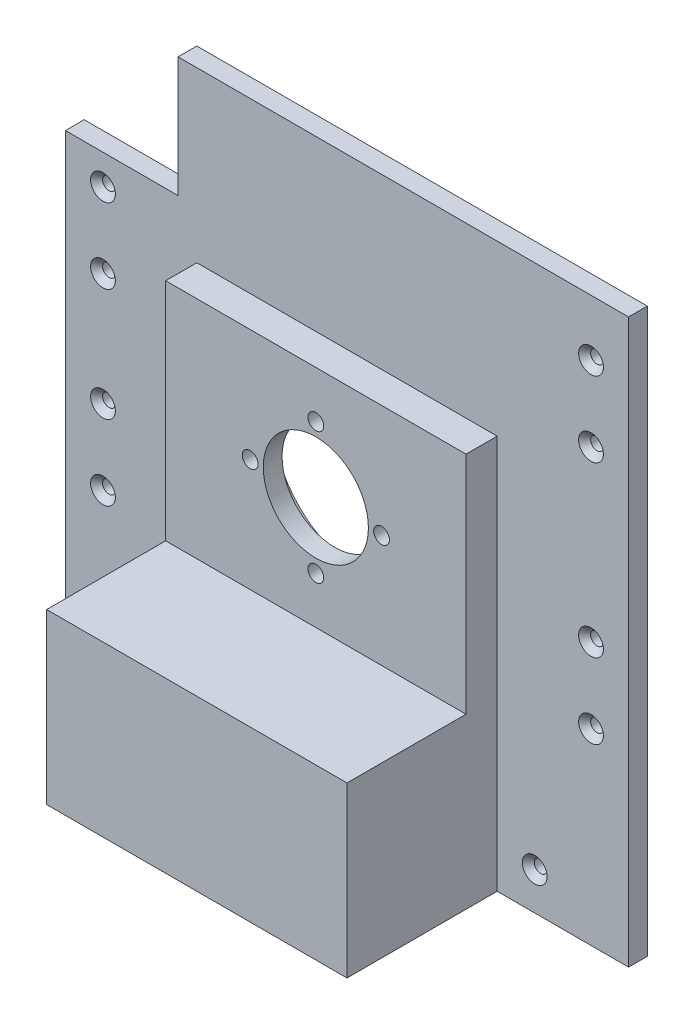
ISO-10303-21;
HEADER;
FILE_DESCRIPTION(('STEP AP214'),'2;1');
FILE_NAME('part.step','',(''),(''),'','','');
FILE_SCHEMA(('AUTOMOTIVE_DESIGN { 1 0 10303 214 1 1 1 1 }'));
ENDSEC;
DATA;
#1=APPLICATION_CONTEXT('core data for automotive mechanical design processes');
#2=APPLICATION_PROTOCOL_DEFINITION('international standard','automotive_design',2000,#1);
#3=PRODUCT_CONTEXT('',#1,'mechanical');
#4=PRODUCT('Part','Part','',(#3));
#5=PRODUCT_RELATED_PRODUCT_CATEGORY('part','',(#4));
#6=PRODUCT_DEFINITION_FORMATION('','',#4);
#7=PRODUCT_DEFINITION_CONTEXT('part definition',#1,'design');
#8=PRODUCT_DEFINITION('design','',#6,#7);
#9=PRODUCT_DEFINITION_SHAPE('','',#8);
#10=(LENGTH_UNIT() NAMED_UNIT(*) SI_UNIT(.MILLI.,.METRE.));
#11=(NAMED_UNIT(*) PLANE_ANGLE_UNIT() SI_UNIT($,.RADIAN.));
#12=(NAMED_UNIT(*) SI_UNIT($,.STERADIAN.) SOLID_ANGLE_UNIT());
#13=UNCERTAINTY_MEASURE_WITH_UNIT(LENGTH_MEASURE(1.E-05),#10,'distance_accuracy_value','');
#14=(GEOMETRIC_REPRESENTATION_CONTEXT(3) GLOBAL_UNCERTAINTY_ASSIGNED_CONTEXT((#13)) GLOBAL_UNIT_ASSIGNED_CONTEXT((#10,
#11,#12)) REPRESENTATION_CONTEXT('',''));
#15=CARTESIAN_POINT('',(0.,0.,0.));
#16=DIRECTION('',(0.,0.,1.));
#17=DIRECTION('',(1.,0.,0.));
#18=AXIS2_PLACEMENT_3D('',#15,#16,#17);
#19=CARTESIAN_POINT('',(0.,0.,5.));
#20=DIRECTION('',(0.,0.,1.));
#21=DIRECTION('',(1.,0.,0.));
#22=AXIS2_PLACEMENT_3D('',#19,#20,#21);
#23=PLANE('',#22);
#24=DIRECTION('',(0.,1.,0.));
#25=VECTOR('',#24,1.);
#26=CARTESIAN_POINT('',(-45.,75.,5.));
#27=LINE('',#26,#25);
#28=CARTESIAN_POINT('',(-45.,43.,5.));
#29=VERTEX_POINT('',#28);
#30=CARTESIAN_POINT('',(-45.,75.,5.));
#31=VERTEX_POINT('',#30);
#32=EDGE_CURVE('E137',#29,#31,#27,.T.);
#33=ORIENTED_EDGE('',*,*,#32,.F.);
#34=DIRECTION('',(1.,0.,0.));
#35=VECTOR('',#34,1.);
#36=CARTESIAN_POINT('',(-45.,43.,5.));
#37=LINE('',#36,#35);
#38=CARTESIAN_POINT('',(-75.,43.,5.));
#39=VERTEX_POINT('',#38);
#40=EDGE_CURVE('E152',#39,#29,#37,.T.);
#41=ORIENTED_EDGE('',*,*,#40,.F.);
#42=DIRECTION('',(0.,-1.,0.));
#43=VECTOR('',#42,1.);
#44=CARTESIAN_POINT('',(-75.,75.,5.));
#45=LINE('',#44,#43);
#46=CARTESIAN_POINT('',(-75.,-75.,5.));
#47=VERTEX_POINT('',#46);
#48=EDGE_CURVE('E404',#39,#47,#45,.T.);
#49=ORIENTED_EDGE('',*,*,#48,.T.);
#50=DIRECTION('',(1.,0.,0.));
#51=VECTOR('',#50,1.);
#52=CARTESIAN_POINT('',(-75.,-75.,5.));
#53=LINE('',#52,#51);
#54=CARTESIAN_POINT('',(-40.,-75.,5.));
#55=VERTEX_POINT('',#54);
#56=EDGE_CURVE('E178',#47,#55,#53,.T.);
#57=ORIENTED_EDGE('',*,*,#56,.T.);
#58=DIRECTION('',(0.,-1.,0.));
#59=VECTOR('',#58,1.);
#60=CARTESIAN_POINT('',(-40.,30.,5.));
#61=LINE('',#60,#59);
#62=CARTESIAN_POINT('',(-40.,30.,5.));
#63=VERTEX_POINT('',#62);
#64=EDGE_CURVE('E374',#63,#55,#61,.T.);
#65=ORIENTED_EDGE('',*,*,#64,.F.);
#66=DIRECTION('',(-1.,0.,0.));
#67=VECTOR('',#66,1.);
#68=CARTESIAN_POINT('',(-40.,30.,5.));
#69=LINE('',#68,#67);
#70=CARTESIAN_POINT('',(40.,30.,5.));
#71=VERTEX_POINT('',#70);
#72=EDGE_CURVE('E70',#71,#63,#69,.T.);
#73=ORIENTED_EDGE('',*,*,#72,.F.);
#74=DIRECTION('',(0.,1.,0.));
#75=VECTOR('',#74,1.);
#76=CARTESIAN_POINT('',(40.,30.,5.));
#77=LINE('',#76,#75);
#78=CARTESIAN_POINT('',(40.,-75.,5.));
#79=VERTEX_POINT('',#78);
#80=EDGE_CURVE('E368',#79,#71,#77,.T.);
#81=ORIENTED_EDGE('',*,*,#80,.F.);
#82=CARTESIAN_POINT('',(75.,-75.,5.));
#83=VERTEX_POINT('',#82);
#84=EDGE_CURVE('E406',#79,#83,#53,.T.);
#85=ORIENTED_EDGE('',*,*,#84,.T.);
#86=DIRECTION('',(0.,1.,0.));
#87=VECTOR('',#86,1.);
#88=CARTESIAN_POINT('',(75.,75.,5.));
#89=LINE('',#88,#87);
#90=CARTESIAN_POINT('',(75.,75.,5.));
#91=VERTEX_POINT('',#90);
#92=EDGE_CURVE('E173',#83,#91,#89,.T.);
#93=ORIENTED_EDGE('',*,*,#92,.T.);
#94=DIRECTION('',(-1.,0.,0.));
#95=VECTOR('',#94,1.);
#96=CARTESIAN_POINT('',(-75.,75.,5.));
#97=LINE('',#96,#95);
#98=EDGE_CURVE('E401',#91,#31,#97,.T.);
#99=ORIENTED_EDGE('',*,*,#98,.T.);
#100=EDGE_LOOP('',(#33,#41,#49,#57,#65,#73,#81,#85,#93,#99));
#101=FACE_BOUND('',#100,.T.);
#102=CARTESIAN_POINT('',(-65.,-65.,5.));
#103=DIRECTION('',(0.,0.,1.));
#104=DIRECTION('',(1.,0.,0.));
#105=AXIS2_PLACEMENT_3D('',#102,#103,#104);
#106=CIRCLE('',#105,3.3);
#107=CARTESIAN_POINT('',(-61.7,-65.,5.));
#108=VERTEX_POINT('',#107);
#109=EDGE_CURVE('E991',#108,#108,#106,.T.);
#110=ORIENTED_EDGE('',*,*,#109,.F.);
#111=EDGE_LOOP('',(#110));
#112=FACE_BOUND('',#111,.T.);
#113=CARTESIAN_POINT('',(50.,-65.,5.));
#114=DIRECTION('',(0.,0.,1.));
#115=DIRECTION('',(1.,0.,0.));
#116=AXIS2_PLACEMENT_3D('',#113,#114,#115);
#117=CIRCLE('',#116,3.3);
#118=CARTESIAN_POINT('',(53.3,-65.,5.));
#119=VERTEX_POINT('',#118);
#120=EDGE_CURVE('E241',#119,#119,#117,.T.);
#121=ORIENTED_EDGE('',*,*,#120,.F.);
#122=EDGE_LOOP('',(#121));
#123=FACE_BOUND('',#122,.T.);
#124=CARTESIAN_POINT('',(65.,60.,5.));
#125=DIRECTION('',(0.,0.,1.));
#126=DIRECTION('',(1.,0.,0.));
#127=AXIS2_PLACEMENT_3D('',#124,#125,#126);
#128=CIRCLE('',#127,3.3);
#129=CARTESIAN_POINT('',(68.3,60.,5.));
#130=VERTEX_POINT('',#129);
#131=EDGE_CURVE('E231',#130,#130,#128,.T.);
#132=ORIENTED_EDGE('',*,*,#131,.F.);
#133=EDGE_LOOP('',(#132));
#134=FACE_BOUND('',#133,.T.);
#135=CARTESIAN_POINT('',(65.,40.,5.));
#136=DIRECTION('',(0.,0.,1.));
#137=DIRECTION('',(1.,0.,0.));
#138=AXIS2_PLACEMENT_3D('',#135,#136,#137);
#139=CIRCLE('',#138,3.3);
#140=CARTESIAN_POINT('',(68.3,40.,5.));
#141=VERTEX_POINT('',#140);
#142=EDGE_CURVE('E226',#141,#141,#139,.T.);
#143=ORIENTED_EDGE('',*,*,#142,.F.);
#144=EDGE_LOOP('',(#143));
#145=FACE_BOUND('',#144,.T.);
#146=CARTESIAN_POINT('',(65.,-4.99999999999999,5.));
#147=DIRECTION('',(0.,0.,1.));
#148=DIRECTION('',(1.,0.,0.));
#149=AXIS2_PLACEMENT_3D('',#146,#147,#148);
#150=CIRCLE('',#149,3.3);
#151=CARTESIAN_POINT('',(68.3,-4.99999999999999,5.));
#152=VERTEX_POINT('',#151);
#153=EDGE_CURVE('E221',#152,#152,#150,.T.);
#154=ORIENTED_EDGE('',*,*,#153,.F.);
#155=EDGE_LOOP('',(#154));
#156=FACE_BOUND('',#155,.T.);
#157=CARTESIAN_POINT('',(65.,-25.,5.));
#158=DIRECTION('',(0.,0.,1.));
#159=DIRECTION('',(1.,0.,0.));
#160=AXIS2_PLACEMENT_3D('',#157,#158,#159);
#161=CIRCLE('',#160,3.3);
#162=CARTESIAN_POINT('',(68.3,-25.,5.));
#163=VERTEX_POINT('',#162);
#164=EDGE_CURVE('E215',#163,#163,#161,.T.);
#165=ORIENTED_EDGE('',*,*,#164,.F.);
#166=EDGE_LOOP('',(#165));
#167=FACE_BOUND('',#166,.T.);
#168=CARTESIAN_POINT('',(-65.,35.,5.));
#169=DIRECTION('',(0.,0.,1.));
#170=DIRECTION('',(1.,0.,0.));
#171=AXIS2_PLACEMENT_3D('',#168,#169,#170);
#172=CIRCLE('',#171,3.3);
#173=CARTESIAN_POINT('',(-61.7,35.,5.));
#174=VERTEX_POINT('',#173);
#175=EDGE_CURVE('E209',#174,#174,#172,.T.);
#176=ORIENTED_EDGE('',*,*,#175,.F.);
#177=EDGE_LOOP('',(#176));
#178=FACE_BOUND('',#177,.T.);
#179=CARTESIAN_POINT('',(-65.,15.,5.));
#180=DIRECTION('',(0.,0.,1.));
#181=DIRECTION('',(1.,0.,0.));
#182=AXIS2_PLACEMENT_3D('',#179,#180,#181);
#183=CIRCLE('',#182,3.3);
#184=CARTESIAN_POINT('',(-61.7,15.,5.));
#185=VERTEX_POINT('',#184);
#186=EDGE_CURVE('E203',#185,#185,#183,.T.);
#187=ORIENTED_EDGE('',*,*,#186,.F.);
#188=EDGE_LOOP('',(#187));
#189=FACE_BOUND('',#188,.T.);
#190=CARTESIAN_POINT('',(-65.,-15.,5.));
#191=DIRECTION('',(0.,0.,1.));
#192=DIRECTION('',(1.,0.,0.));
#193=AXIS2_PLACEMENT_3D('',#190,#191,#192);
#194=CIRCLE('',#193,3.3);
#195=CARTESIAN_POINT('',(-61.7,-15.,5.));
#196=VERTEX_POINT('',#195);
#197=EDGE_CURVE('E198',#196,#196,#194,.T.);
#198=ORIENTED_EDGE('',*,*,#197,.F.);
#199=EDGE_LOOP('',(#198));
#200=FACE_BOUND('',#199,.T.);
#201=CARTESIAN_POINT('',(-65.,-35.,5.));
#202=DIRECTION('',(0.,0.,1.));
#203=DIRECTION('',(1.,0.,0.));
#204=AXIS2_PLACEMENT_3D('',#201,#202,#203);
#205=CIRCLE('',#204,3.3);
#206=CARTESIAN_POINT('',(-61.7,-35.,5.));
#207=VERTEX_POINT('',#206);
#208=EDGE_CURVE('E192',#207,#207,#205,.T.);
#209=ORIENTED_EDGE('',*,*,#208,.F.);
#210=EDGE_LOOP('',(#209));
#211=FACE_BOUND('',#210,.T.);
#212=ADVANCED_FACE('F44',(#101,#112,#123,#134,#145,#156,#167,#178,#189,#200,#211),#23,.T.);
#213=CARTESIAN_POINT('',(75.,75.,5.));
#214=DIRECTION('',(-1.,0.,0.));
#215=DIRECTION('',(0.,0.,1.));
#216=AXIS2_PLACEMENT_3D('',#213,#214,#215);
#217=PLANE('',#216);
#218=DIRECTION('',(0.,1.,0.));
#219=VECTOR('',#218,1.);
#220=CARTESIAN_POINT('',(75.,75.,0.));
#221=LINE('',#220,#219);
#222=CARTESIAN_POINT('',(75.,-75.,0.));
#223=VERTEX_POINT('',#222);
#224=CARTESIAN_POINT('',(75.,75.,0.));
#225=VERTEX_POINT('',#224);
#226=EDGE_CURVE('E159',#223,#225,#221,.T.);
#227=ORIENTED_EDGE('',*,*,#226,.T.);
#228=DIRECTION('',(0.,0.,-1.));
#229=VECTOR('',#228,1.);
#230=CARTESIAN_POINT('',(75.,75.,5.));
#231=LINE('',#230,#229);
#232=EDGE_CURVE('E11',#91,#225,#231,.T.);
#233=ORIENTED_EDGE('',*,*,#232,.F.);
#234=ORIENTED_EDGE('',*,*,#92,.F.);
#235=DIRECTION('',(0.,0.,-1.));
#236=VECTOR('',#235,1.);
#237=CARTESIAN_POINT('',(75.,-75.,5.));
#238=LINE('',#237,#236);
#239=EDGE_CURVE('E174',#83,#223,#238,.T.);
#240=ORIENTED_EDGE('',*,*,#239,.T.);
#241=EDGE_LOOP('',(#227,#233,#234,#240));
#242=FACE_BOUND('',#241,.T.);
#243=ADVANCED_FACE('F46',(#242),#217,.F.);
#244=CARTESIAN_POINT('',(-75.,75.,5.));
#245=DIRECTION('',(0.,-1.,0.));
#246=DIRECTION('',(0.,0.,-1.));
#247=AXIS2_PLACEMENT_3D('',#244,#245,#246);
#248=PLANE('',#247);
#249=DIRECTION('',(-1.,0.,0.));
#250=VECTOR('',#249,1.);
#251=CARTESIAN_POINT('',(-75.,75.,0.));
#252=LINE('',#251,#250);
#253=CARTESIAN_POINT('',(-45.,75.,0.));
#254=VERTEX_POINT('',#253);
#255=EDGE_CURVE('E149',#225,#254,#252,.T.);
#256=ORIENTED_EDGE('',*,*,#255,.T.);
#257=DIRECTION('',(0.,0.,1.));
#258=VECTOR('',#257,1.);
#259=CARTESIAN_POINT('',(-45.,75.,0.));
#260=LINE('',#259,#258);
#261=EDGE_CURVE('E134',#254,#31,#260,.T.);
#262=ORIENTED_EDGE('',*,*,#261,.T.);
#263=ORIENTED_EDGE('',*,*,#98,.F.);
#264=ORIENTED_EDGE('',*,*,#232,.T.);
#265=EDGE_LOOP('',(#256,#262,#263,#264));
#266=FACE_BOUND('',#265,.T.);
#267=ADVANCED_FACE('F154',(#266),#248,.F.);
#268=CARTESIAN_POINT('',(-75.,75.,5.));
#269=DIRECTION('',(1.,0.,0.));
#270=DIRECTION('',(0.,1.,0.));
#271=AXIS2_PLACEMENT_3D('',#268,#269,#270);
#272=PLANE('',#271);
#273=ORIENTED_EDGE('',*,*,#48,.F.);
#274=DIRECTION('',(0.,0.,1.));
#275=VECTOR('',#274,1.);
#276=CARTESIAN_POINT('',(-75.,43.,0.));
#277=LINE('',#276,#275);
#278=CARTESIAN_POINT('',(-75.,43.,0.));
#279=VERTEX_POINT('',#278);
#280=EDGE_CURVE('E142',#279,#39,#277,.T.);
#281=ORIENTED_EDGE('',*,*,#280,.F.);
#282=DIRECTION('',(0.,-1.,0.));
#283=VECTOR('',#282,1.);
#284=CARTESIAN_POINT('',(-75.,75.,0.));
#285=LINE('',#284,#283);
#286=CARTESIAN_POINT('',(-75.,-75.,0.));
#287=VERTEX_POINT('',#286);
#288=EDGE_CURVE('E158',#279,#287,#285,.T.);
#289=ORIENTED_EDGE('',*,*,#288,.T.);
#290=DIRECTION('',(0.,0.,-1.));
#291=VECTOR('',#290,1.);
#292=CARTESIAN_POINT('',(-75.,-75.,5.));
#293=LINE('',#292,#291);
#294=EDGE_CURVE('E54',#47,#287,#293,.T.);
#295=ORIENTED_EDGE('',*,*,#294,.F.);
#296=EDGE_LOOP('',(#273,#281,#289,#295));
#297=FACE_BOUND('',#296,.T.);
#298=ADVANCED_FACE('F424',(#297),#272,.F.);
#299=CARTESIAN_POINT('',(-75.,-75.,5.));
#300=DIRECTION('',(0.,1.,0.));
#301=DIRECTION('',(0.,0.,1.));
#302=AXIS2_PLACEMENT_3D('',#299,#300,#301);
#303=PLANE('',#302);
#304=DIRECTION('',(1.,0.,0.));
#305=VECTOR('',#304,1.);
#306=CARTESIAN_POINT('',(-75.,-75.,0.));
#307=LINE('',#306,#305);
#308=EDGE_CURVE('E164',#287,#223,#307,.T.);
#309=ORIENTED_EDGE('',*,*,#308,.T.);
#310=ORIENTED_EDGE('',*,*,#239,.F.);
#311=ORIENTED_EDGE('',*,*,#84,.F.);
#312=DIRECTION('',(0.,0.,-1.));
#313=VECTOR('',#312,1.);
#314=CARTESIAN_POINT('',(40.,-75.,45.));
#315=LINE('',#314,#313);
#316=CARTESIAN_POINT('',(40.,-75.,45.));
#317=VERTEX_POINT('',#316);
#318=EDGE_CURVE('E360',#317,#79,#315,.T.);
#319=ORIENTED_EDGE('',*,*,#318,.F.);
#320=DIRECTION('',(1.,0.,0.));
#321=VECTOR('',#320,1.);
#322=CARTESIAN_POINT('',(-40.,-75.,45.));
#323=LINE('',#322,#321);
#324=CARTESIAN_POINT('',(-40.,-75.,45.));
#325=VERTEX_POINT('',#324);
#326=EDGE_CURVE('E345',#325,#317,#323,.T.);
#327=ORIENTED_EDGE('',*,*,#326,.F.);
#328=DIRECTION('',(0.,0.,-1.));
#329=VECTOR('',#328,1.);
#330=CARTESIAN_POINT('',(-40.,-75.,45.));
#331=LINE('',#330,#329);
#332=EDGE_CURVE('E364',#325,#55,#331,.T.);
#333=ORIENTED_EDGE('',*,*,#332,.T.);
#334=ORIENTED_EDGE('',*,*,#56,.F.);
#335=ORIENTED_EDGE('',*,*,#294,.T.);
#336=EDGE_LOOP('',(#309,#310,#311,#319,#327,#333,#334,#335));
#337=FACE_BOUND('',#336,.T.);
#338=ADVANCED_FACE('F417',(#337),#303,.F.);
#339=CARTESIAN_POINT('',(0.,0.,0.));
#340=DIRECTION('',(0.,0.,1.));
#341=DIRECTION('',(1.,0.,0.));
#342=AXIS2_PLACEMENT_3D('',#339,#340,#341);
#343=PLANE('',#342);
#344=CARTESIAN_POINT('',(-65.,-65.,0.));
#345=DIRECTION('',(0.,0.,1.));
#346=DIRECTION('',(1.,0.,0.));
#347=AXIS2_PLACEMENT_3D('',#344,#345,#346);
#348=CIRCLE('',#347,1.69999999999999);
#349=CARTESIAN_POINT('',(-63.3,-65.,0.));
#350=VERTEX_POINT('',#349);
#351=EDGE_CURVE('E48',#350,#350,#348,.T.);
#352=ORIENTED_EDGE('',*,*,#351,.T.);
#353=EDGE_LOOP('',(#352));
#354=FACE_BOUND('',#353,.T.);
#355=CARTESIAN_POINT('',(50.,-65.,0.));
#356=DIRECTION('',(0.,0.,1.));
#357=DIRECTION('',(1.,0.,0.));
#358=AXIS2_PLACEMENT_3D('',#355,#356,#357);
#359=CIRCLE('',#358,1.69999999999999);
#360=CARTESIAN_POINT('',(51.7,-65.,0.));
#361=VERTEX_POINT('',#360);
#362=EDGE_CURVE('E228',#361,#361,#359,.T.);
#363=ORIENTED_EDGE('',*,*,#362,.T.);
#364=EDGE_LOOP('',(#363));
#365=FACE_BOUND('',#364,.T.);
#366=CARTESIAN_POINT('',(65.,60.,0.));
#367=DIRECTION('',(0.,0.,1.));
#368=DIRECTION('',(1.,0.,0.));
#369=AXIS2_PLACEMENT_3D('',#366,#367,#368);
#370=CIRCLE('',#369,1.69999999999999);
#371=CARTESIAN_POINT('',(66.7,60.,0.));
#372=VERTEX_POINT('',#371);
#373=EDGE_CURVE('E223',#372,#372,#370,.T.);
#374=ORIENTED_EDGE('',*,*,#373,.T.);
#375=EDGE_LOOP('',(#374));
#376=FACE_BOUND('',#375,.T.);
#377=CARTESIAN_POINT('',(65.,40.,0.));
#378=DIRECTION('',(0.,0.,1.));
#379=DIRECTION('',(1.,0.,0.));
#380=AXIS2_PLACEMENT_3D('',#377,#378,#379);
#381=CIRCLE('',#380,1.69999999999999);
#382=CARTESIAN_POINT('',(66.7,40.,0.));
#383=VERTEX_POINT('',#382);
#384=EDGE_CURVE('E217',#383,#383,#381,.T.);
#385=ORIENTED_EDGE('',*,*,#384,.T.);
#386=EDGE_LOOP('',(#385));
#387=FACE_BOUND('',#386,.T.);
#388=CARTESIAN_POINT('',(65.,-4.99999999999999,0.));
#389=DIRECTION('',(0.,0.,1.));
#390=DIRECTION('',(1.,0.,0.));
#391=AXIS2_PLACEMENT_3D('',#388,#389,#390);
#392=CIRCLE('',#391,1.69999999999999);
#393=CARTESIAN_POINT('',(66.7,-4.99999999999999,0.));
#394=VERTEX_POINT('',#393);
#395=EDGE_CURVE('E211',#394,#394,#392,.T.);
#396=ORIENTED_EDGE('',*,*,#395,.T.);
#397=EDGE_LOOP('',(#396));
#398=FACE_BOUND('',#397,.T.);
#399=CARTESIAN_POINT('',(65.,-25.,0.));
#400=DIRECTION('',(0.,0.,1.));
#401=DIRECTION('',(1.,0.,0.));
#402=AXIS2_PLACEMENT_3D('',#399,#400,#401);
#403=CIRCLE('',#402,1.69999999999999);
#404=CARTESIAN_POINT('',(66.7,-25.,0.));
#405=VERTEX_POINT('',#404);
#406=EDGE_CURVE('E205',#405,#405,#403,.T.);
#407=ORIENTED_EDGE('',*,*,#406,.T.);
#408=EDGE_LOOP('',(#407));
#409=FACE_BOUND('',#408,.T.);
#410=CARTESIAN_POINT('',(-65.,35.,0.));
#411=DIRECTION('',(0.,0.,1.));
#412=DIRECTION('',(1.,0.,0.));
#413=AXIS2_PLACEMENT_3D('',#410,#411,#412);
#414=CIRCLE('',#413,1.69999999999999);
#415=CARTESIAN_POINT('',(-63.3,35.,0.));
#416=VERTEX_POINT('',#415);
#417=EDGE_CURVE('E200',#416,#416,#414,.T.);
#418=ORIENTED_EDGE('',*,*,#417,.T.);
#419=EDGE_LOOP('',(#418));
#420=FACE_BOUND('',#419,.T.);
#421=CARTESIAN_POINT('',(-65.,15.,0.));
#422=DIRECTION('',(0.,0.,1.));
#423=DIRECTION('',(1.,0.,0.));
#424=AXIS2_PLACEMENT_3D('',#421,#422,#423);
#425=CIRCLE('',#424,1.69999999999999);
#426=CARTESIAN_POINT('',(-63.3,15.,0.));
#427=VERTEX_POINT('',#426);
#428=EDGE_CURVE('E194',#427,#427,#425,.T.);
#429=ORIENTED_EDGE('',*,*,#428,.T.);
#430=EDGE_LOOP('',(#429));
#431=FACE_BOUND('',#430,.T.);
#432=CARTESIAN_POINT('',(-65.,-15.,0.));
#433=DIRECTION('',(0.,0.,1.));
#434=DIRECTION('',(1.,0.,0.));
#435=AXIS2_PLACEMENT_3D('',#432,#433,#434);
#436=CIRCLE('',#435,1.69999999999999);
#437=CARTESIAN_POINT('',(-63.3,-15.,0.));
#438=VERTEX_POINT('',#437);
#439=EDGE_CURVE('E188',#438,#438,#436,.T.);
#440=ORIENTED_EDGE('',*,*,#439,.T.);
#441=EDGE_LOOP('',(#440));
#442=FACE_BOUND('',#441,.T.);
#443=CARTESIAN_POINT('',(-65.,-35.,0.));
#444=DIRECTION('',(0.,0.,1.));
#445=DIRECTION('',(1.,0.,0.));
#446=AXIS2_PLACEMENT_3D('',#443,#444,#445);
#447=CIRCLE('',#446,1.69999999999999);
#448=CARTESIAN_POINT('',(-63.3,-35.,0.));
#449=VERTEX_POINT('',#448);
#450=EDGE_CURVE('E182',#449,#449,#447,.T.);
#451=ORIENTED_EDGE('',*,*,#450,.T.);
#452=EDGE_LOOP('',(#451));
#453=FACE_BOUND('',#452,.T.);
#454=CARTESIAN_POINT('',(0.,0.,0.));
#455=DIRECTION('',(0.,0.,-1.));
#456=DIRECTION('',(-1.,0.,0.));
#457=AXIS2_PLACEMENT_3D('',#454,#455,#456);
#458=CIRCLE('',#457,25.);
#459=CARTESIAN_POINT('',(-25.,0.,0.));
#460=VERTEX_POINT('',#459);
#461=EDGE_CURVE('E333',#460,#460,#458,.T.);
#462=ORIENTED_EDGE('',*,*,#461,.F.);
#463=EDGE_LOOP('',(#462));
#464=FACE_BOUND('',#463,.T.);
#465=DIRECTION('',(1.,0.,0.));
#466=VECTOR('',#465,1.);
#467=CARTESIAN_POINT('',(-45.,43.,0.));
#468=LINE('',#467,#466);
#469=CARTESIAN_POINT('',(-45.,43.,0.));
#470=VERTEX_POINT('',#469);
#471=EDGE_CURVE('E143',#279,#470,#468,.T.);
#472=ORIENTED_EDGE('',*,*,#471,.T.);
#473=DIRECTION('',(0.,1.,0.));
#474=VECTOR('',#473,1.);
#475=CARTESIAN_POINT('',(-45.,75.,0.));
#476=LINE('',#475,#474);
#477=EDGE_CURVE('E62',#470,#254,#476,.T.);
#478=ORIENTED_EDGE('',*,*,#477,.T.);
#479=ORIENTED_EDGE('',*,*,#255,.F.);
#480=ORIENTED_EDGE('',*,*,#226,.F.);
#481=ORIENTED_EDGE('',*,*,#308,.F.);
#482=ORIENTED_EDGE('',*,*,#288,.F.);
#483=EDGE_LOOP('',(#472,#478,#479,#480,#481,#482));
#484=FACE_BOUND('',#483,.T.);
#485=ADVANCED_FACE('F147',(#354,#365,#376,#387,#398,#409,#420,#431,#442,#453,#464,#484),#343,.F.);
#486=CARTESIAN_POINT('',(40.,30.,13.3));
#487=DIRECTION('',(-1.,0.,0.));
#488=DIRECTION('',(0.,0.,1.));
#489=AXIS2_PLACEMENT_3D('',#486,#487,#488);
#490=PLANE('',#489);
#491=ORIENTED_EDGE('',*,*,#80,.T.);
#492=DIRECTION('',(0.,0.,-1.));
#493=VECTOR('',#492,1.);
#494=CARTESIAN_POINT('',(40.,30.,13.3));
#495=LINE('',#494,#493);
#496=CARTESIAN_POINT('',(40.,30.,13.3));
#497=VERTEX_POINT('',#496);
#498=EDGE_CURVE('E167',#497,#71,#495,.T.);
#499=ORIENTED_EDGE('',*,*,#498,.F.);
#500=DIRECTION('',(0.,1.,0.));
#501=VECTOR('',#500,1.);
#502=CARTESIAN_POINT('',(40.,30.,13.3));
#503=LINE('',#502,#501);
#504=CARTESIAN_POINT('',(40.,-30.,13.3));
#505=VERTEX_POINT('',#504);
#506=EDGE_CURVE('E369',#505,#497,#503,.T.);
#507=ORIENTED_EDGE('',*,*,#506,.F.);
#508=DIRECTION('',(0.,0.,-1.));
#509=VECTOR('',#508,1.);
#510=CARTESIAN_POINT('',(40.,-30.,45.));
#511=LINE('',#510,#509);
#512=CARTESIAN_POINT('',(40.,-30.,45.));
#513=VERTEX_POINT('',#512);
#514=EDGE_CURVE('E357',#513,#505,#511,.T.);
#515=ORIENTED_EDGE('',*,*,#514,.F.);
#516=DIRECTION('',(0.,1.,0.));
#517=VECTOR('',#516,1.);
#518=CARTESIAN_POINT('',(40.,-30.,45.));
#519=LINE('',#518,#517);
#520=EDGE_CURVE('E348',#317,#513,#519,.T.);
#521=ORIENTED_EDGE('',*,*,#520,.F.);
#522=ORIENTED_EDGE('',*,*,#318,.T.);
#523=EDGE_LOOP('',(#491,#499,#507,#515,#521,#522));
#524=FACE_BOUND('',#523,.T.);
#525=ADVANCED_FACE('F436',(#524),#490,.F.);
#526=CARTESIAN_POINT('',(-40.,30.,13.3));
#527=DIRECTION('',(0.,-1.,0.));
#528=DIRECTION('',(0.,0.,-1.));
#529=AXIS2_PLACEMENT_3D('',#526,#527,#528);
#530=PLANE('',#529);
#531=ORIENTED_EDGE('',*,*,#72,.T.);
#532=DIRECTION('',(0.,0.,-1.));
#533=VECTOR('',#532,1.);
#534=CARTESIAN_POINT('',(-40.,30.,13.3));
#535=LINE('',#534,#533);
#536=CARTESIAN_POINT('',(-40.,30.,13.3));
#537=VERTEX_POINT('',#536);
#538=EDGE_CURVE('E385',#537,#63,#535,.T.);
#539=ORIENTED_EDGE('',*,*,#538,.F.);
#540=DIRECTION('',(-1.,0.,0.));
#541=VECTOR('',#540,1.);
#542=CARTESIAN_POINT('',(-40.,30.,13.3));
#543=LINE('',#542,#541);
#544=EDGE_CURVE('E373',#497,#537,#543,.T.);
#545=ORIENTED_EDGE('',*,*,#544,.F.);
#546=ORIENTED_EDGE('',*,*,#498,.T.);
#547=EDGE_LOOP('',(#531,#539,#545,#546));
#548=FACE_BOUND('',#547,.T.);
#549=ADVANCED_FACE('F432',(#548),#530,.F.);
#550=CARTESIAN_POINT('',(-40.,30.,13.3));
#551=DIRECTION('',(1.,0.,0.));
#552=DIRECTION('',(0.,1.,0.));
#553=AXIS2_PLACEMENT_3D('',#550,#551,#552);
#554=PLANE('',#553);
#555=ORIENTED_EDGE('',*,*,#64,.T.);
#556=ORIENTED_EDGE('',*,*,#332,.F.);
#557=DIRECTION('',(0.,-1.,0.));
#558=VECTOR('',#557,1.);
#559=CARTESIAN_POINT('',(-40.,-30.,45.));
#560=LINE('',#559,#558);
#561=CARTESIAN_POINT('',(-40.,-30.,45.));
#562=VERTEX_POINT('',#561);
#563=EDGE_CURVE('E338',#562,#325,#560,.T.);
#564=ORIENTED_EDGE('',*,*,#563,.F.);
#565=DIRECTION('',(0.,0.,-1.));
#566=VECTOR('',#565,1.);
#567=CARTESIAN_POINT('',(-40.,-30.,45.));
#568=LINE('',#567,#566);
#569=CARTESIAN_POINT('',(-40.,-30.,13.3));
#570=VERTEX_POINT('',#569);
#571=EDGE_CURVE('E353',#562,#570,#568,.T.);
#572=ORIENTED_EDGE('',*,*,#571,.T.);
#573=DIRECTION('',(0.,-1.,0.));
#574=VECTOR('',#573,1.);
#575=CARTESIAN_POINT('',(-40.,30.,13.3));
#576=LINE('',#575,#574);
#577=EDGE_CURVE('E377',#537,#570,#576,.T.);
#578=ORIENTED_EDGE('',*,*,#577,.F.);
#579=ORIENTED_EDGE('',*,*,#538,.T.);
#580=EDGE_LOOP('',(#555,#556,#564,#572,#578,#579));
#581=FACE_BOUND('',#580,.T.);
#582=ADVANCED_FACE('F428',(#581),#554,.F.);
#583=CARTESIAN_POINT('',(0.,0.,13.3));
#584=DIRECTION('',(0.,0.,1.));
#585=DIRECTION('',(1.,0.,0.));
#586=AXIS2_PLACEMENT_3D('',#583,#584,#585);
#587=PLANE('',#586);
#588=CARTESIAN_POINT('',(0.,0.,13.3));
#589=DIRECTION('',(0.,0.,1.));
#590=DIRECTION('',(1.,0.,0.));
#591=AXIS2_PLACEMENT_3D('',#588,#589,#590);
#592=CIRCLE('',#591,14.);
#593=CARTESIAN_POINT('',(14.,0.,13.3));
#594=VERTEX_POINT('',#593);
#595=EDGE_CURVE('E298',#594,#594,#592,.T.);
#596=ORIENTED_EDGE('',*,*,#595,.F.);
#597=EDGE_LOOP('',(#596));
#598=FACE_BOUND('',#597,.T.);
#599=CARTESIAN_POINT('',(0.,17.5,13.3));
#600=DIRECTION('',(0.,0.,1.));
#601=DIRECTION('',(1.,0.,0.));
#602=AXIS2_PLACEMENT_3D('',#599,#600,#601);
#603=CIRCLE('',#602,2.1);
#604=CARTESIAN_POINT('',(2.1,17.5,13.3));
#605=VERTEX_POINT('',#604);
#606=EDGE_CURVE('E305',#605,#605,#603,.T.);
#607=ORIENTED_EDGE('',*,*,#606,.F.);
#608=EDGE_LOOP('',(#607));
#609=FACE_BOUND('',#608,.T.);
#610=CARTESIAN_POINT('',(17.5,0.,13.3));
#611=DIRECTION('',(0.,0.,1.));
#612=DIRECTION('',(1.,0.,0.));
#613=AXIS2_PLACEMENT_3D('',#610,#611,#612);
#614=CIRCLE('',#613,2.1);
#615=CARTESIAN_POINT('',(19.6,0.,13.3));
#616=VERTEX_POINT('',#615);
#617=EDGE_CURVE('E313',#616,#616,#614,.T.);
#618=ORIENTED_EDGE('',*,*,#617,.F.);
#619=EDGE_LOOP('',(#618));
#620=FACE_BOUND('',#619,.T.);
#621=CARTESIAN_POINT('',(0.,-17.5,13.3));
#622=DIRECTION('',(0.,0.,1.));
#623=DIRECTION('',(1.,0.,0.));
#624=AXIS2_PLACEMENT_3D('',#621,#622,#623);
#625=CIRCLE('',#624,2.1);
#626=CARTESIAN_POINT('',(2.1,-17.5,13.3));
#627=VERTEX_POINT('',#626);
#628=EDGE_CURVE('E321',#627,#627,#625,.T.);
#629=ORIENTED_EDGE('',*,*,#628,.F.);
#630=EDGE_LOOP('',(#629));
#631=FACE_BOUND('',#630,.T.);
#632=CARTESIAN_POINT('',(-17.5,0.,13.3));
#633=DIRECTION('',(0.,0.,1.));
#634=DIRECTION('',(1.,0.,0.));
#635=AXIS2_PLACEMENT_3D('',#632,#633,#634);
#636=CIRCLE('',#635,2.1);
#637=CARTESIAN_POINT('',(-15.4,0.,13.3));
#638=VERTEX_POINT('',#637);
#639=EDGE_CURVE('E329',#638,#638,#636,.T.);
#640=ORIENTED_EDGE('',*,*,#639,.F.);
#641=EDGE_LOOP('',(#640));
#642=FACE_BOUND('',#641,.T.);
#643=ORIENTED_EDGE('',*,*,#506,.T.);
#644=ORIENTED_EDGE('',*,*,#544,.T.);
#645=ORIENTED_EDGE('',*,*,#577,.T.);
#646=DIRECTION('',(1.,0.,0.));
#647=VECTOR('',#646,1.);
#648=CARTESIAN_POINT('',(-40.,-30.,13.3));
#649=LINE('',#648,#647);
#650=EDGE_CURVE('E381',#570,#505,#649,.T.);
#651=ORIENTED_EDGE('',*,*,#650,.T.);
#652=EDGE_LOOP('',(#643,#644,#645,#651));
#653=FACE_BOUND('',#652,.T.);
#654=ADVANCED_FACE('F446',(#598,#609,#620,#631,#642,#653),#587,.T.);
#655=CARTESIAN_POINT('',(-40.,-30.,45.));
#656=DIRECTION('',(0.,-1.,0.));
#657=DIRECTION('',(0.,0.,-1.));
#658=AXIS2_PLACEMENT_3D('',#655,#656,#657);
#659=PLANE('',#658);
#660=ORIENTED_EDGE('',*,*,#650,.F.);
#661=ORIENTED_EDGE('',*,*,#571,.F.);
#662=DIRECTION('',(-1.,0.,0.));
#663=VECTOR('',#662,1.);
#664=CARTESIAN_POINT('',(-40.,-30.,45.));
#665=LINE('',#664,#663);
#666=EDGE_CURVE('E350',#513,#562,#665,.T.);
#667=ORIENTED_EDGE('',*,*,#666,.F.);
#668=ORIENTED_EDGE('',*,*,#514,.T.);
#669=EDGE_LOOP('',(#660,#661,#667,#668));
#670=FACE_BOUND('',#669,.T.);
#671=ADVANCED_FACE('F444',(#670),#659,.F.);
#672=CARTESIAN_POINT('',(0.,0.,45.));
#673=DIRECTION('',(0.,0.,1.));
#674=DIRECTION('',(1.,0.,0.));
#675=AXIS2_PLACEMENT_3D('',#672,#673,#674);
#676=PLANE('',#675);
#677=ORIENTED_EDGE('',*,*,#563,.T.);
#678=ORIENTED_EDGE('',*,*,#326,.T.);
#679=ORIENTED_EDGE('',*,*,#520,.T.);
#680=ORIENTED_EDGE('',*,*,#666,.T.);
#681=EDGE_LOOP('',(#677,#678,#679,#680));
#682=FACE_BOUND('',#681,.T.);
#683=ADVANCED_FACE('F441',(#682),#676,.T.);
#684=CARTESIAN_POINT('',(0.,0.,8.3));
#685=DIRECTION('',(0.,0.,-1.));
#686=DIRECTION('',(-1.,0.,0.));
#687=AXIS2_PLACEMENT_3D('',#684,#685,#686);
#688=CYLINDRICAL_SURFACE('',#687,25.);
#689=CARTESIAN_POINT('',(0.,0.,8.3));
#690=DIRECTION('',(0.,0.,-1.));
#691=DIRECTION('',(-1.,0.,0.));
#692=AXIS2_PLACEMENT_3D('',#689,#690,#691);
#693=CIRCLE('',#692,25.);
#694=CARTESIAN_POINT('',(-25.,0.,8.3));
#695=VERTEX_POINT('',#694);
#696=EDGE_CURVE('E334',#695,#695,#693,.T.);
#697=CARTESIAN_POINT('',(-25.,0.,8.3));
#698=CARTESIAN_POINT('',(-25.,0.,8.21354166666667));
#699=CARTESIAN_POINT('',(-25.,0.,8.12708333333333));
#700=CARTESIAN_POINT('',(-25.,0.,7.95416666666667));
#701=CARTESIAN_POINT('',(-25.,0.,7.86770833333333));
#702=CARTESIAN_POINT('',(-25.,0.,7.69479166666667));
#703=CARTESIAN_POINT('',(-25.,0.,7.60833333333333));
#704=CARTESIAN_POINT('',(-25.,0.,7.43541666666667));
#705=CARTESIAN_POINT('',(-25.,0.,7.34895833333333));
#706=CARTESIAN_POINT('',(-25.,0.,7.17604166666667));
#707=CARTESIAN_POINT('',(-25.,0.,7.08958333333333));
#708=CARTESIAN_POINT('',(-25.,0.,6.91666666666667));
#709=CARTESIAN_POINT('',(-25.,0.,6.83020833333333));
#710=CARTESIAN_POINT('',(-25.,0.,6.65729166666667));
#711=CARTESIAN_POINT('',(-25.,0.,6.57083333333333));
#712=CARTESIAN_POINT('',(-25.,0.,6.39791666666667));
#713=CARTESIAN_POINT('',(-25.,0.,6.31145833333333));
#714=CARTESIAN_POINT('',(-25.,0.,6.13854166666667));
#715=CARTESIAN_POINT('',(-25.,0.,6.05208333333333));
#716=CARTESIAN_POINT('',(-25.,0.,5.87916666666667));
#717=CARTESIAN_POINT('',(-25.,0.,5.79270833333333));
#718=CARTESIAN_POINT('',(-25.,0.,5.61979166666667));
#719=CARTESIAN_POINT('',(-25.,0.,5.53333333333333));
#720=CARTESIAN_POINT('',(-25.,0.,5.36041666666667));
#721=CARTESIAN_POINT('',(-25.,0.,5.27395833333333));
#722=CARTESIAN_POINT('',(-25.,0.,5.10104166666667));
#723=CARTESIAN_POINT('',(-25.,0.,5.01458333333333));
#724=CARTESIAN_POINT('',(-25.,0.,4.84166666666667));
#725=CARTESIAN_POINT('',(-25.,0.,4.75520833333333));
#726=CARTESIAN_POINT('',(-25.,0.,4.58229166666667));
#727=CARTESIAN_POINT('',(-25.,0.,4.49583333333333));
#728=CARTESIAN_POINT('',(-25.,0.,4.32291666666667));
#729=CARTESIAN_POINT('',(-25.,0.,4.23645833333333));
#730=CARTESIAN_POINT('',(-25.,0.,4.06354166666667));
#731=CARTESIAN_POINT('',(-25.,0.,3.97708333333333));
#732=CARTESIAN_POINT('',(-25.,0.,3.80416666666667));
#733=CARTESIAN_POINT('',(-25.,0.,3.71770833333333));
#734=CARTESIAN_POINT('',(-25.,0.,3.54479166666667));
#735=CARTESIAN_POINT('',(-25.,0.,3.45833333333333));
#736=CARTESIAN_POINT('',(-25.,0.,3.28541666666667));
#737=CARTESIAN_POINT('',(-25.,0.,3.19895833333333));
#738=CARTESIAN_POINT('',(-25.,0.,3.02604166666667));
#739=CARTESIAN_POINT('',(-25.,0.,2.93958333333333));
#740=CARTESIAN_POINT('',(-25.,0.,2.76666666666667));
#741=CARTESIAN_POINT('',(-25.,0.,2.68020833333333));
#742=CARTESIAN_POINT('',(-25.,0.,2.50729166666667));
#743=CARTESIAN_POINT('',(-25.,0.,2.42083333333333));
#744=CARTESIAN_POINT('',(-25.,0.,2.24791666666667));
#745=CARTESIAN_POINT('',(-25.,0.,2.16145833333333));
#746=CARTESIAN_POINT('',(-25.,0.,1.98854166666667));
#747=CARTESIAN_POINT('',(-25.,0.,1.90208333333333));
#748=CARTESIAN_POINT('',(-25.,0.,1.72916666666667));
#749=CARTESIAN_POINT('',(-25.,0.,1.64270833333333));
#750=CARTESIAN_POINT('',(-25.,0.,1.46979166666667));
#751=CARTESIAN_POINT('',(-25.,0.,1.38333333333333));
#752=CARTESIAN_POINT('',(-25.,0.,1.21041666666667));
#753=CARTESIAN_POINT('',(-25.,0.,1.12395833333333));
#754=CARTESIAN_POINT('',(-25.,0.,0.951041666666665));
#755=CARTESIAN_POINT('',(-25.,0.,0.864583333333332));
#756=CARTESIAN_POINT('',(-25.,0.,0.691666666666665));
#757=CARTESIAN_POINT('',(-25.,0.,0.605208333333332));
#758=CARTESIAN_POINT('',(-25.,0.,0.432291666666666));
#759=CARTESIAN_POINT('',(-25.,0.,0.345833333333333));
#760=CARTESIAN_POINT('',(-25.,0.,0.172916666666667));
#761=CARTESIAN_POINT('',(-25.,0.,0.0864583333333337));
#762=CARTESIAN_POINT('',(-25.,0.,0.));
#763=B_SPLINE_CURVE_WITH_KNOTS('',3,(#697,#698,#699,#700,#701,#702,#703,#704,#705,#706,#707,
#708,#709,#710,#711,#712,#713,#714,#715,#716,#717,#718,#719,#720,#721,#722,#723,#724,#725,#726,
#727,#728,#729,#730,#731,#732,#733,#734,#735,#736,#737,#738,#739,#740,#741,#742,#743,#744,#745,
#746,#747,#748,#749,#750,#751,#752,#753,#754,#755,#756,#757,#758,#759,#760,#761,#762),
.UNSPECIFIED.,.F.,.F.,(4,2,2,2,2,2,2,2,2,2,2,2,2,2,2,2,2,2,2,2,2,2,2,2,2,2,2,2,2,2,2,2,4),(0.,
0.259375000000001,0.518750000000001,0.778125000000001,1.0375,1.296875,1.55625,1.815625,2.075,
2.334375,2.59375,2.853125,3.1125,3.371875,3.63125,3.890625,4.15,4.409375,4.66875,4.928125,
5.1875,5.446875,5.70625,5.965625,6.225,6.484375,6.74375,7.003125,7.2625,7.521875,7.78125,
8.040625,8.3),.UNSPECIFIED.);
#764=EDGE_CURVE('BSEAM514',#695,#460,#763,.T.);
#765=ORIENTED_EDGE('',*,*,#696,.F.);
#766=ORIENTED_EDGE('',*,*,#461,.T.);
#767=ORIENTED_EDGE('',*,*,#764,.T.);
#768=ORIENTED_EDGE('',*,*,#764,.F.);
#769=EDGE_LOOP('',(#765,#767,#766,#768));
#770=FACE_BOUND('',#769,.T.);
#771=ADVANCED_FACE('F514',(#770),#688,.F.);
#772=CARTESIAN_POINT('',(0.,0.,8.3));
#773=DIRECTION('',(0.,0.,-1.));
#774=DIRECTION('',(-1.,0.,0.));
#775=AXIS2_PLACEMENT_3D('',#772,#773,#774);
#776=PLANE('',#775);
#777=CARTESIAN_POINT('',(0.,0.,8.3));
#778=DIRECTION('',(0.,0.,-1.));
#779=DIRECTION('',(-1.,0.,0.));
#780=AXIS2_PLACEMENT_3D('',#777,#778,#779);
#781=CIRCLE('',#780,14.);
#782=CARTESIAN_POINT('',(-14.,0.,8.3));
#783=VERTEX_POINT('',#782);
#784=EDGE_CURVE('E186',#783,#783,#781,.T.);
#785=ORIENTED_EDGE('',*,*,#784,.F.);
#786=EDGE_LOOP('',(#785));
#787=FACE_BOUND('',#786,.T.);
#788=CARTESIAN_POINT('',(0.,17.5,8.3));
#789=DIRECTION('',(0.,0.,-1.));
#790=DIRECTION('',(-1.,0.,0.));
#791=AXIS2_PLACEMENT_3D('',#788,#789,#790);
#792=CIRCLE('',#791,2.1);
#793=CARTESIAN_POINT('',(-2.1,17.5,8.3));
#794=VERTEX_POINT('',#793);
#795=EDGE_CURVE('E302',#794,#794,#792,.T.);
#796=ORIENTED_EDGE('',*,*,#795,.F.);
#797=EDGE_LOOP('',(#796));
#798=FACE_BOUND('',#797,.T.);
#799=CARTESIAN_POINT('',(17.5,0.,8.3));
#800=DIRECTION('',(0.,0.,-1.));
#801=DIRECTION('',(-1.,0.,0.));
#802=AXIS2_PLACEMENT_3D('',#799,#800,#801);
#803=CIRCLE('',#802,2.1);
#804=CARTESIAN_POINT('',(15.4,0.,8.3));
#805=VERTEX_POINT('',#804);
#806=EDGE_CURVE('E309',#805,#805,#803,.T.);
#807=ORIENTED_EDGE('',*,*,#806,.F.);
#808=EDGE_LOOP('',(#807));
#809=FACE_BOUND('',#808,.T.);
#810=CARTESIAN_POINT('',(0.,-17.5,8.3));
#811=DIRECTION('',(0.,0.,-1.));
#812=DIRECTION('',(-1.,0.,0.));
#813=AXIS2_PLACEMENT_3D('',#810,#811,#812);
#814=CIRCLE('',#813,2.1);
#815=CARTESIAN_POINT('',(-2.1,-17.5,8.3));
#816=VERTEX_POINT('',#815);
#817=EDGE_CURVE('E317',#816,#816,#814,.T.);
#818=ORIENTED_EDGE('',*,*,#817,.F.);
#819=EDGE_LOOP('',(#818));
#820=FACE_BOUND('',#819,.T.);
#821=CARTESIAN_POINT('',(-17.5,0.,8.3));
#822=DIRECTION('',(0.,0.,-1.));
#823=DIRECTION('',(-1.,0.,0.));
#824=AXIS2_PLACEMENT_3D('',#821,#822,#823);
#825=CIRCLE('',#824,2.1);
#826=CARTESIAN_POINT('',(-19.6,0.,8.3));
#827=VERTEX_POINT('',#826);
#828=EDGE_CURVE('E325',#827,#827,#825,.T.);
#829=ORIENTED_EDGE('',*,*,#828,.F.);
#830=EDGE_LOOP('',(#829));
#831=FACE_BOUND('',#830,.T.);
#832=ORIENTED_EDGE('',*,*,#696,.T.);
#833=EDGE_LOOP('',(#832));
#834=FACE_BOUND('',#833,.T.);
#835=ADVANCED_FACE('F522',(#787,#798,#809,#820,#831,#834),#776,.T.);
#836=CARTESIAN_POINT('',(-17.5,0.,8.3));
#837=DIRECTION('',(0.,0.,-1.));
#838=DIRECTION('',(-1.,0.,0.));
#839=AXIS2_PLACEMENT_3D('',#836,#837,#838);
#840=CYLINDRICAL_SURFACE('',#839,2.1);
#841=ORIENTED_EDGE('',*,*,#639,.T.);
#842=EDGE_LOOP('',(#841));
#843=FACE_BOUND('',#842,.T.);
#844=ORIENTED_EDGE('',*,*,#828,.T.);
#845=EDGE_LOOP('',(#844));
#846=FACE_BOUND('',#845,.T.);
#847=ADVANCED_FACE('F531',(#843,#846),#840,.F.);
#848=CARTESIAN_POINT('',(0.,-17.5,8.3));
#849=DIRECTION('',(0.,0.,-1.));
#850=DIRECTION('',(-1.,0.,0.));
#851=AXIS2_PLACEMENT_3D('',#848,#849,#850);
#852=CYLINDRICAL_SURFACE('',#851,2.1);
#853=ORIENTED_EDGE('',*,*,#628,.T.);
#854=EDGE_LOOP('',(#853));
#855=FACE_BOUND('',#854,.T.);
#856=ORIENTED_EDGE('',*,*,#817,.T.);
#857=EDGE_LOOP('',(#856));
#858=FACE_BOUND('',#857,.T.);
#859=ADVANCED_FACE('F541',(#855,#858),#852,.F.);
#860=CARTESIAN_POINT('',(17.5,0.,8.3));
#861=DIRECTION('',(0.,0.,-1.));
#862=DIRECTION('',(-1.,0.,0.));
#863=AXIS2_PLACEMENT_3D('',#860,#861,#862);
#864=CYLINDRICAL_SURFACE('',#863,2.1);
#865=ORIENTED_EDGE('',*,*,#617,.T.);
#866=EDGE_LOOP('',(#865));
#867=FACE_BOUND('',#866,.T.);
#868=ORIENTED_EDGE('',*,*,#806,.T.);
#869=EDGE_LOOP('',(#868));
#870=FACE_BOUND('',#869,.T.);
#871=ADVANCED_FACE('F550',(#867,#870),#864,.F.);
#872=CARTESIAN_POINT('',(0.,17.5,8.3));
#873=DIRECTION('',(0.,0.,-1.));
#874=DIRECTION('',(-1.,0.,0.));
#875=AXIS2_PLACEMENT_3D('',#872,#873,#874);
#876=CYLINDRICAL_SURFACE('',#875,2.1);
#877=ORIENTED_EDGE('',*,*,#606,.T.);
#878=EDGE_LOOP('',(#877));
#879=FACE_BOUND('',#878,.T.);
#880=ORIENTED_EDGE('',*,*,#795,.T.);
#881=EDGE_LOOP('',(#880));
#882=FACE_BOUND('',#881,.T.);
#883=ADVANCED_FACE('F559',(#879,#882),#876,.F.);
#884=CARTESIAN_POINT('',(0.,0.,18.3));
#885=DIRECTION('',(0.,0.,-1.));
#886=DIRECTION('',(-1.,0.,0.));
#887=AXIS2_PLACEMENT_3D('',#884,#885,#886);
#888=CYLINDRICAL_SURFACE('',#887,14.);
#889=ORIENTED_EDGE('',*,*,#595,.T.);
#890=EDGE_LOOP('',(#889));
#891=FACE_BOUND('',#890,.T.);
#892=ORIENTED_EDGE('',*,*,#784,.T.);
#893=EDGE_LOOP('',(#892));
#894=FACE_BOUND('',#893,.T.);
#895=ADVANCED_FACE('F568',(#891,#894),#888,.F.);
#896=CARTESIAN_POINT('',(-65.,-35.,5.));
#897=DIRECTION('',(0.,0.,1.));
#898=DIRECTION('',(1.,0.,0.));
#899=AXIS2_PLACEMENT_3D('',#896,#897,#898);
#900=CYLINDRICAL_SURFACE('',#899,1.69999999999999);
#901=CARTESIAN_POINT('',(-65.,-35.,3.4));
#902=DIRECTION('',(0.,0.,1.));
#903=DIRECTION('',(1.,0.,0.));
#904=AXIS2_PLACEMENT_3D('',#901,#902,#903);
#905=CIRCLE('',#904,1.69999999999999);
#906=CARTESIAN_POINT('',(-63.3,-35.,3.4));
#907=VERTEX_POINT('',#906);
#908=EDGE_CURVE('E187',#907,#907,#905,.T.);
#909=ORIENTED_EDGE('',*,*,#908,.T.);
#910=EDGE_LOOP('',(#909));
#911=FACE_BOUND('',#910,.T.);
#912=ORIENTED_EDGE('',*,*,#450,.F.);
#913=EDGE_LOOP('',(#912));
#914=FACE_BOUND('',#913,.T.);
#915=ADVANCED_FACE('F575',(#911,#914),#900,.F.);
#916=CARTESIAN_POINT('',(-65.,-35.,5.));
#917=DIRECTION('',(0.,0.,1.));
#918=DIRECTION('',(1.,0.,0.));
#919=AXIS2_PLACEMENT_3D('',#916,#917,#918);
#920=CONICAL_SURFACE('',#919,3.3,0.785398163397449);
#921=ORIENTED_EDGE('',*,*,#908,.F.);
#922=EDGE_LOOP('',(#921));
#923=FACE_BOUND('',#922,.T.);
#924=ORIENTED_EDGE('',*,*,#208,.T.);
#925=EDGE_LOOP('',(#924));
#926=FACE_BOUND('',#925,.T.);
#927=ADVANCED_FACE('F584',(#923,#926),#920,.F.);
#928=CARTESIAN_POINT('',(-65.,-15.,5.));
#929=DIRECTION('',(0.,0.,1.));
#930=DIRECTION('',(1.,0.,0.));
#931=AXIS2_PLACEMENT_3D('',#928,#929,#930);
#932=CYLINDRICAL_SURFACE('',#931,1.69999999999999);
#933=CARTESIAN_POINT('',(-65.,-15.,3.4));
#934=DIRECTION('',(0.,0.,1.));
#935=DIRECTION('',(1.,0.,0.));
#936=AXIS2_PLACEMENT_3D('',#933,#934,#935);
#937=CIRCLE('',#936,1.69999999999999);
#938=CARTESIAN_POINT('',(-63.3,-15.,3.4));
#939=VERTEX_POINT('',#938);
#940=EDGE_CURVE('E193',#939,#939,#937,.T.);
#941=ORIENTED_EDGE('',*,*,#940,.T.);
#942=EDGE_LOOP('',(#941));
#943=FACE_BOUND('',#942,.T.);
#944=ORIENTED_EDGE('',*,*,#439,.F.);
#945=EDGE_LOOP('',(#944));
#946=FACE_BOUND('',#945,.T.);
#947=ADVANCED_FACE('F594',(#943,#946),#932,.F.);
#948=CARTESIAN_POINT('',(-65.,-15.,5.));
#949=DIRECTION('',(0.,0.,1.));
#950=DIRECTION('',(1.,0.,0.));
#951=AXIS2_PLACEMENT_3D('',#948,#949,#950);
#952=CONICAL_SURFACE('',#951,3.3,0.785398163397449);
#953=ORIENTED_EDGE('',*,*,#940,.F.);
#954=EDGE_LOOP('',(#953));
#955=FACE_BOUND('',#954,.T.);
#956=ORIENTED_EDGE('',*,*,#197,.T.);
#957=EDGE_LOOP('',(#956));
#958=FACE_BOUND('',#957,.T.);
#959=ADVANCED_FACE('F603',(#955,#958),#952,.F.);
#960=CARTESIAN_POINT('',(-65.,15.,5.));
#961=DIRECTION('',(0.,0.,1.));
#962=DIRECTION('',(1.,0.,0.));
#963=AXIS2_PLACEMENT_3D('',#960,#961,#962);
#964=CYLINDRICAL_SURFACE('',#963,1.69999999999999);
#965=CARTESIAN_POINT('',(-65.,15.,3.4));
#966=DIRECTION('',(0.,0.,1.));
#967=DIRECTION('',(1.,0.,0.));
#968=AXIS2_PLACEMENT_3D('',#965,#966,#967);
#969=CIRCLE('',#968,1.69999999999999);
#970=CARTESIAN_POINT('',(-63.3,15.,3.4));
#971=VERTEX_POINT('',#970);
#972=EDGE_CURVE('E199',#971,#971,#969,.T.);
#973=ORIENTED_EDGE('',*,*,#972,.T.);
#974=EDGE_LOOP('',(#973));
#975=FACE_BOUND('',#974,.T.);
#976=ORIENTED_EDGE('',*,*,#428,.F.);
#977=EDGE_LOOP('',(#976));
#978=FACE_BOUND('',#977,.T.);
#979=ADVANCED_FACE('F612',(#975,#978),#964,.F.);
#980=CARTESIAN_POINT('',(-65.,15.,5.));
#981=DIRECTION('',(0.,0.,1.));
#982=DIRECTION('',(1.,0.,0.));
#983=AXIS2_PLACEMENT_3D('',#980,#981,#982);
#984=CONICAL_SURFACE('',#983,3.3,0.785398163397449);
#985=ORIENTED_EDGE('',*,*,#972,.F.);
#986=EDGE_LOOP('',(#985));
#987=FACE_BOUND('',#986,.T.);
#988=ORIENTED_EDGE('',*,*,#186,.T.);
#989=EDGE_LOOP('',(#988));
#990=FACE_BOUND('',#989,.T.);
#991=ADVANCED_FACE('F621',(#987,#990),#984,.F.);
#992=CARTESIAN_POINT('',(-65.,35.,5.));
#993=DIRECTION('',(0.,0.,1.));
#994=DIRECTION('',(1.,0.,0.));
#995=AXIS2_PLACEMENT_3D('',#992,#993,#994);
#996=CYLINDRICAL_SURFACE('',#995,1.69999999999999);
#997=CARTESIAN_POINT('',(-65.,35.,3.4));
#998=DIRECTION('',(0.,0.,1.));
#999=DIRECTION('',(1.,0.,0.));
#1000=AXIS2_PLACEMENT_3D('',#997,#998,#999);
#1001=CIRCLE('',#1000,1.69999999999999);
#1002=CARTESIAN_POINT('',(-63.3,35.,3.4));
#1003=VERTEX_POINT('',#1002);
#1004=EDGE_CURVE('E204',#1003,#1003,#1001,.T.);
#1005=ORIENTED_EDGE('',*,*,#1004,.T.);
#1006=EDGE_LOOP('',(#1005));
#1007=FACE_BOUND('',#1006,.T.);
#1008=ORIENTED_EDGE('',*,*,#417,.F.);
#1009=EDGE_LOOP('',(#1008));
#1010=FACE_BOUND('',#1009,.T.);
#1011=ADVANCED_FACE('F630',(#1007,#1010),#996,.F.);
#1012=CARTESIAN_POINT('',(-65.,35.,5.));
#1013=DIRECTION('',(0.,0.,1.));
#1014=DIRECTION('',(1.,0.,0.));
#1015=AXIS2_PLACEMENT_3D('',#1012,#1013,#1014);
#1016=CONICAL_SURFACE('',#1015,3.3,0.785398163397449);
#1017=ORIENTED_EDGE('',*,*,#1004,.F.);
#1018=EDGE_LOOP('',(#1017));
#1019=FACE_BOUND('',#1018,.T.);
#1020=ORIENTED_EDGE('',*,*,#175,.T.);
#1021=EDGE_LOOP('',(#1020));
#1022=FACE_BOUND('',#1021,.T.);
#1023=ADVANCED_FACE('F638',(#1019,#1022),#1016,.F.);
#1024=CARTESIAN_POINT('',(65.,-25.,5.));
#1025=DIRECTION('',(0.,0.,1.));
#1026=DIRECTION('',(1.,0.,0.));
#1027=AXIS2_PLACEMENT_3D('',#1024,#1025,#1026);
#1028=CYLINDRICAL_SURFACE('',#1027,1.69999999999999);
#1029=CARTESIAN_POINT('',(65.,-25.,3.39999999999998));
#1030=DIRECTION('',(0.,0.,1.));
#1031=DIRECTION('',(1.,0.,0.));
#1032=AXIS2_PLACEMENT_3D('',#1029,#1030,#1031);
#1033=CIRCLE('',#1032,1.69999999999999);
#1034=CARTESIAN_POINT('',(66.7,-25.,3.39999999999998));
#1035=VERTEX_POINT('',#1034);
#1036=EDGE_CURVE('E210',#1035,#1035,#1033,.T.);
#1037=ORIENTED_EDGE('',*,*,#1036,.T.);
#1038=EDGE_LOOP('',(#1037));
#1039=FACE_BOUND('',#1038,.T.);
#1040=ORIENTED_EDGE('',*,*,#406,.F.);
#1041=EDGE_LOOP('',(#1040));
#1042=FACE_BOUND('',#1041,.T.);
#1043=ADVANCED_FACE('F647',(#1039,#1042),#1028,.F.);
#1044=CARTESIAN_POINT('',(65.,-25.,5.));
#1045=DIRECTION('',(0.,0.,1.));
#1046=DIRECTION('',(1.,0.,0.));
#1047=AXIS2_PLACEMENT_3D('',#1044,#1045,#1046);
#1048=CONICAL_SURFACE('',#1047,3.3,0.785398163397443);
#1049=ORIENTED_EDGE('',*,*,#1036,.F.);
#1050=EDGE_LOOP('',(#1049));
#1051=FACE_BOUND('',#1050,.T.);
#1052=ORIENTED_EDGE('',*,*,#164,.T.);
#1053=EDGE_LOOP('',(#1052));
#1054=FACE_BOUND('',#1053,.T.);
#1055=ADVANCED_FACE('F655',(#1051,#1054),#1048,.F.);
#1056=CARTESIAN_POINT('',(65.,-4.99999999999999,5.));
#1057=DIRECTION('',(0.,0.,1.));
#1058=DIRECTION('',(1.,0.,0.));
#1059=AXIS2_PLACEMENT_3D('',#1056,#1057,#1058);
#1060=CYLINDRICAL_SURFACE('',#1059,1.69999999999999);
#1061=CARTESIAN_POINT('',(65.,-4.99999999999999,3.39999999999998));
#1062=DIRECTION('',(0.,0.,1.));
#1063=DIRECTION('',(1.,0.,0.));
#1064=AXIS2_PLACEMENT_3D('',#1061,#1062,#1063);
#1065=CIRCLE('',#1064,1.69999999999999);
#1066=CARTESIAN_POINT('',(66.7,-4.99999999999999,3.39999999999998));
#1067=VERTEX_POINT('',#1066);
#1068=EDGE_CURVE('E216',#1067,#1067,#1065,.T.);
#1069=ORIENTED_EDGE('',*,*,#1068,.T.);
#1070=EDGE_LOOP('',(#1069));
#1071=FACE_BOUND('',#1070,.T.);
#1072=ORIENTED_EDGE('',*,*,#395,.F.);
#1073=EDGE_LOOP('',(#1072));
#1074=FACE_BOUND('',#1073,.T.);
#1075=ADVANCED_FACE('F664',(#1071,#1074),#1060,.F.);
#1076=CARTESIAN_POINT('',(65.,-4.99999999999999,5.));
#1077=DIRECTION('',(0.,0.,1.));
#1078=DIRECTION('',(1.,0.,0.));
#1079=AXIS2_PLACEMENT_3D('',#1076,#1077,#1078);
#1080=CONICAL_SURFACE('',#1079,3.3,0.785398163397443);
#1081=ORIENTED_EDGE('',*,*,#1068,.F.);
#1082=EDGE_LOOP('',(#1081));
#1083=FACE_BOUND('',#1082,.T.);
#1084=ORIENTED_EDGE('',*,*,#153,.T.);
#1085=EDGE_LOOP('',(#1084));
#1086=FACE_BOUND('',#1085,.T.);
#1087=ADVANCED_FACE('F673',(#1083,#1086),#1080,.F.);
#1088=CARTESIAN_POINT('',(65.,40.,5.));
#1089=DIRECTION('',(0.,0.,1.));
#1090=DIRECTION('',(1.,0.,0.));
#1091=AXIS2_PLACEMENT_3D('',#1088,#1089,#1090);
#1092=CYLINDRICAL_SURFACE('',#1091,1.69999999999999);
#1093=CARTESIAN_POINT('',(65.,40.,3.39999999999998));
#1094=DIRECTION('',(0.,0.,1.));
#1095=DIRECTION('',(1.,0.,0.));
#1096=AXIS2_PLACEMENT_3D('',#1093,#1094,#1095);
#1097=CIRCLE('',#1096,1.69999999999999);
#1098=CARTESIAN_POINT('',(66.7,40.,3.39999999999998));
#1099=VERTEX_POINT('',#1098);
#1100=EDGE_CURVE('E222',#1099,#1099,#1097,.T.);
#1101=ORIENTED_EDGE('',*,*,#1100,.T.);
#1102=EDGE_LOOP('',(#1101));
#1103=FACE_BOUND('',#1102,.T.);
#1104=ORIENTED_EDGE('',*,*,#384,.F.);
#1105=EDGE_LOOP('',(#1104));
#1106=FACE_BOUND('',#1105,.T.);
#1107=ADVANCED_FACE('F682',(#1103,#1106),#1092,.F.);
#1108=CARTESIAN_POINT('',(65.,40.,5.));
#1109=DIRECTION('',(0.,0.,1.));
#1110=DIRECTION('',(1.,0.,0.));
#1111=AXIS2_PLACEMENT_3D('',#1108,#1109,#1110);
#1112=CONICAL_SURFACE('',#1111,3.3,0.785398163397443);
#1113=ORIENTED_EDGE('',*,*,#1100,.F.);
#1114=EDGE_LOOP('',(#1113));
#1115=FACE_BOUND('',#1114,.T.);
#1116=ORIENTED_EDGE('',*,*,#142,.T.);
#1117=EDGE_LOOP('',(#1116));
#1118=FACE_BOUND('',#1117,.T.);
#1119=ADVANCED_FACE('F691',(#1115,#1118),#1112,.F.);
#1120=CARTESIAN_POINT('',(65.,60.,5.));
#1121=DIRECTION('',(0.,0.,1.));
#1122=DIRECTION('',(1.,0.,0.));
#1123=AXIS2_PLACEMENT_3D('',#1120,#1121,#1122);
#1124=CYLINDRICAL_SURFACE('',#1123,1.69999999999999);
#1125=CARTESIAN_POINT('',(65.,60.,3.39999999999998));
#1126=DIRECTION('',(0.,0.,1.));
#1127=DIRECTION('',(1.,0.,0.));
#1128=AXIS2_PLACEMENT_3D('',#1125,#1126,#1127);
#1129=CIRCLE('',#1128,1.69999999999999);
#1130=CARTESIAN_POINT('',(66.7,60.,3.39999999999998));
#1131=VERTEX_POINT('',#1130);
#1132=EDGE_CURVE('E227',#1131,#1131,#1129,.T.);
#1133=ORIENTED_EDGE('',*,*,#1132,.T.);
#1134=EDGE_LOOP('',(#1133));
#1135=FACE_BOUND('',#1134,.T.);
#1136=ORIENTED_EDGE('',*,*,#373,.F.);
#1137=EDGE_LOOP('',(#1136));
#1138=FACE_BOUND('',#1137,.T.);
#1139=ADVANCED_FACE('F700',(#1135,#1138),#1124,.F.);
#1140=CARTESIAN_POINT('',(65.,60.,5.));
#1141=DIRECTION('',(0.,0.,1.));
#1142=DIRECTION('',(1.,0.,0.));
#1143=AXIS2_PLACEMENT_3D('',#1140,#1141,#1142);
#1144=CONICAL_SURFACE('',#1143,3.3,0.785398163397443);
#1145=ORIENTED_EDGE('',*,*,#1132,.F.);
#1146=EDGE_LOOP('',(#1145));
#1147=FACE_BOUND('',#1146,.T.);
#1148=ORIENTED_EDGE('',*,*,#131,.T.);
#1149=EDGE_LOOP('',(#1148));
#1150=FACE_BOUND('',#1149,.T.);
#1151=ADVANCED_FACE('F709',(#1147,#1150),#1144,.F.);
#1152=CARTESIAN_POINT('',(50.,-65.,5.));
#1153=DIRECTION('',(0.,0.,1.));
#1154=DIRECTION('',(1.,0.,0.));
#1155=AXIS2_PLACEMENT_3D('',#1152,#1153,#1154);
#1156=CYLINDRICAL_SURFACE('',#1155,1.69999999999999);
#1157=CARTESIAN_POINT('',(50.,-65.,3.39999999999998));
#1158=DIRECTION('',(0.,0.,1.));
#1159=DIRECTION('',(1.,0.,0.));
#1160=AXIS2_PLACEMENT_3D('',#1157,#1158,#1159);
#1161=CIRCLE('',#1160,1.69999999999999);
#1162=CARTESIAN_POINT('',(51.7,-65.,3.39999999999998));
#1163=VERTEX_POINT('',#1162);
#1164=EDGE_CURVE('E232',#1163,#1163,#1161,.T.);
#1165=ORIENTED_EDGE('',*,*,#1164,.T.);
#1166=EDGE_LOOP('',(#1165));
#1167=FACE_BOUND('',#1166,.T.);
#1168=ORIENTED_EDGE('',*,*,#362,.F.);
#1169=EDGE_LOOP('',(#1168));
#1170=FACE_BOUND('',#1169,.T.);
#1171=ADVANCED_FACE('F718',(#1167,#1170),#1156,.F.);
#1172=CARTESIAN_POINT('',(50.,-65.,5.));
#1173=DIRECTION('',(0.,0.,1.));
#1174=DIRECTION('',(1.,0.,0.));
#1175=AXIS2_PLACEMENT_3D('',#1172,#1173,#1174);
#1176=CONICAL_SURFACE('',#1175,3.3,0.785398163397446);
#1177=ORIENTED_EDGE('',*,*,#1164,.F.);
#1178=EDGE_LOOP('',(#1177));
#1179=FACE_BOUND('',#1178,.T.);
#1180=ORIENTED_EDGE('',*,*,#120,.T.);
#1181=EDGE_LOOP('',(#1180));
#1182=FACE_BOUND('',#1181,.T.);
#1183=ADVANCED_FACE('F727',(#1179,#1182),#1176,.F.);
#1184=CARTESIAN_POINT('',(-65.,-65.,5.));
#1185=DIRECTION('',(0.,0.,1.));
#1186=DIRECTION('',(1.,0.,0.));
#1187=AXIS2_PLACEMENT_3D('',#1184,#1185,#1186);
#1188=CYLINDRICAL_SURFACE('',#1187,1.69999999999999);
#1189=CARTESIAN_POINT('',(-65.,-65.,3.39999999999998));
#1190=DIRECTION('',(0.,0.,1.));
#1191=DIRECTION('',(1.,0.,0.));
#1192=AXIS2_PLACEMENT_3D('',#1189,#1190,#1191);
#1193=CIRCLE('',#1192,1.69999999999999);
#1194=CARTESIAN_POINT('',(-63.3,-65.,3.39999999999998));
#1195=VERTEX_POINT('',#1194);
#1196=EDGE_CURVE('E996',#1195,#1195,#1193,.T.);
#1197=ORIENTED_EDGE('',*,*,#1196,.T.);
#1198=EDGE_LOOP('',(#1197));
#1199=FACE_BOUND('',#1198,.T.);
#1200=ORIENTED_EDGE('',*,*,#351,.F.);
#1201=EDGE_LOOP('',(#1200));
#1202=FACE_BOUND('',#1201,.T.);
#1203=ADVANCED_FACE('F735',(#1199,#1202),#1188,.F.);
#1204=CARTESIAN_POINT('',(-65.,-65.,5.));
#1205=DIRECTION('',(0.,0.,1.));
#1206=DIRECTION('',(1.,0.,0.));
#1207=AXIS2_PLACEMENT_3D('',#1204,#1205,#1206);
#1208=CONICAL_SURFACE('',#1207,3.3,0.785398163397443);
#1209=ORIENTED_EDGE('',*,*,#1196,.F.);
#1210=EDGE_LOOP('',(#1209));
#1211=FACE_BOUND('',#1210,.T.);
#1212=ORIENTED_EDGE('',*,*,#109,.T.);
#1213=EDGE_LOOP('',(#1212));
#1214=FACE_BOUND('',#1213,.T.);
#1215=ADVANCED_FACE('F744',(#1211,#1214),#1208,.F.);
#1216=CARTESIAN_POINT('',(-45.,75.,0.));
#1217=DIRECTION('',(1.,0.,0.));
#1218=DIRECTION('',(0.,1.,0.));
#1219=AXIS2_PLACEMENT_3D('',#1216,#1217,#1218);
#1220=PLANE('',#1219);
#1221=ORIENTED_EDGE('',*,*,#32,.T.);
#1222=ORIENTED_EDGE('',*,*,#261,.F.);
#1223=ORIENTED_EDGE('',*,*,#477,.F.);
#1224=DIRECTION('',(0.,0.,1.));
#1225=VECTOR('',#1224,1.);
#1226=CARTESIAN_POINT('',(-45.,43.,0.));
#1227=LINE('',#1226,#1225);
#1228=EDGE_CURVE('E982',#470,#29,#1227,.T.);
#1229=ORIENTED_EDGE('',*,*,#1228,.T.);
#1230=EDGE_LOOP('',(#1221,#1222,#1223,#1229));
#1231=FACE_BOUND('',#1230,.T.);
#1232=ADVANCED_FACE('F135',(#1231),#1220,.F.);
#1233=CARTESIAN_POINT('',(-45.,43.,0.));
#1234=DIRECTION('',(0.,-1.,0.));
#1235=DIRECTION('',(0.,0.,-1.));
#1236=AXIS2_PLACEMENT_3D('',#1233,#1234,#1235);
#1237=PLANE('',#1236);
#1238=ORIENTED_EDGE('',*,*,#40,.T.);
#1239=ORIENTED_EDGE('',*,*,#1228,.F.);
#1240=ORIENTED_EDGE('',*,*,#471,.F.);
#1241=ORIENTED_EDGE('',*,*,#280,.T.);
#1242=EDGE_LOOP('',(#1238,#1239,#1240,#1241));
#1243=FACE_BOUND('',#1242,.T.);
#1244=ADVANCED_FACE('F762',(#1243),#1237,.F.);
#1245=CLOSED_SHELL('',(#212,#243,#267,#298,#338,#485,#525,#549,#582,#654,#671,#683,#771,#835,
#847,#859,#871,#883,#895,#915,#927,#947,#959,#979,#991,#1011,#1023,#1043,#1055,#1075,#1087,
#1107,#1119,#1139,#1151,#1171,#1183,#1203,#1215,#1232,#1244));
#1246=MANIFOLD_SOLID_BREP('B2',#1245);
#1247=ADVANCED_BREP_SHAPE_REPRESENTATION('',(#18,#1246),#14);
#1248=SHAPE_DEFINITION_REPRESENTATION(#9,#1247);
ENDSEC;
END-ISO-10303-21;
